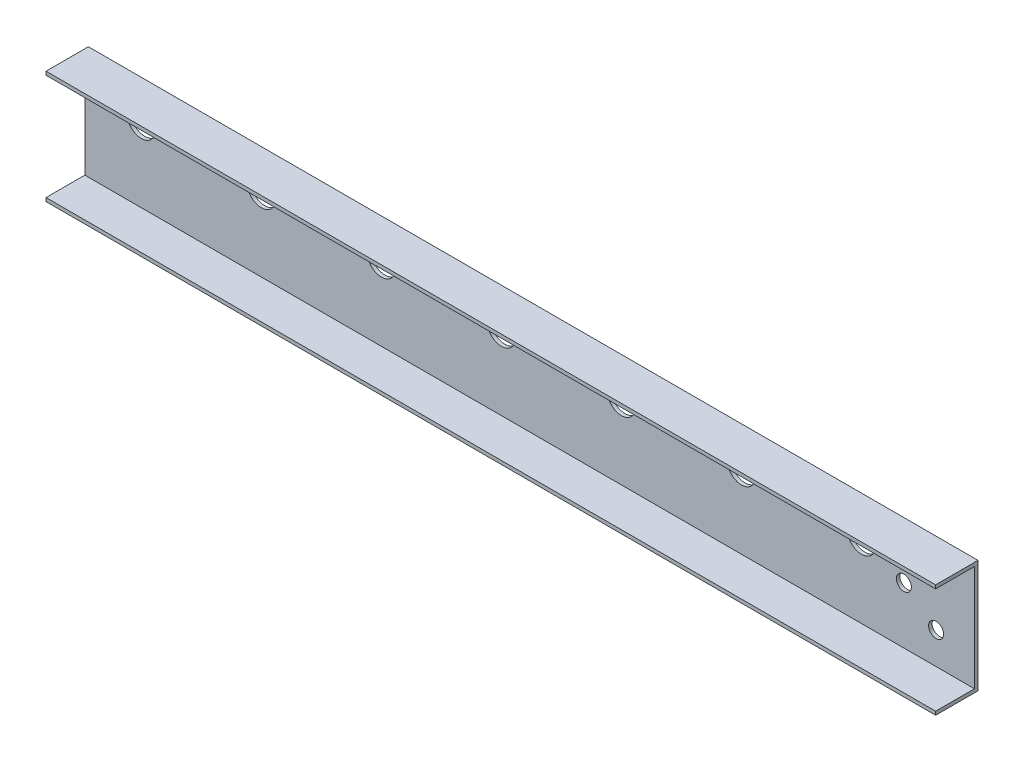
from build123d import *

# Parameters (mm, degrees)
BASE_EXTRUDE_THIN_DEPTH = 800.1
SKETCH2_R               = 12.7
CUT_EXTRUDE1_DEPTH      = 808.424411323
LPATTERN1_COUNT         = 7
LPATTERN1_PITCH         = 107.95
SKETCH3_R               = 6.7437
CUT_EXTRUDE2_DEPTH      = 808.280822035


with BuildPart() as part:
    # Sketch1 → Base-Extrude-Thin (new body)
    with BuildSketch(Plane(origin=(0, 0, 0), x_dir=(0, 0, -1), z_dir=(1, 0, 0))):
        Polygon((-38.1, 0), (0, 0), (0, -101.6), (-38.1, -101.6), (-38.1, -98.425), (-3.175, -98.425), (-3.175, -3.175), (-38.1, -3.175), align=None)
    extrude(amount=BASE_EXTRUDE_THIN_DEPTH)

    # Sketch2 → Cut-Extrude1 (cut, through all)
    with BuildSketch(Plane(origin=(0, 0, 0), x_dir=(-1, 0, 0), z_dir=(0, 0, -1))):
        with Locations(Location((-50.8, -31.75, 0), (0, 0, 90))):
            Circle(SKETCH2_R)
    cut_extrude1 = extrude(amount=-CUT_EXTRUDE1_DEPTH, mode=Mode.SUBTRACT)

    # LPattern1: Cut-Extrude1 ×7
    with Locations(*[(i * LPATTERN1_PITCH, 0, 0) for i in range(1, LPATTERN1_COUNT)]):
        add(cut_extrude1, mode=Mode.SUBTRACT)

    # Sketch3 → Cut-Extrude2 (cut, through all)
    with BuildSketch(Plane.XY.offset(3.175)):
        with Locations((765.564183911, -69.85)):
            Circle(SKETCH3_R)
        with Locations((765.564183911, -25.4)):
            Circle(SKETCH3_R)
        with Locations((736.6, -47.625)):
            Circle(SKETCH3_R)
    extrude(amount=-CUT_EXTRUDE2_DEPTH, mode=Mode.SUBTRACT)


solid = part.part
